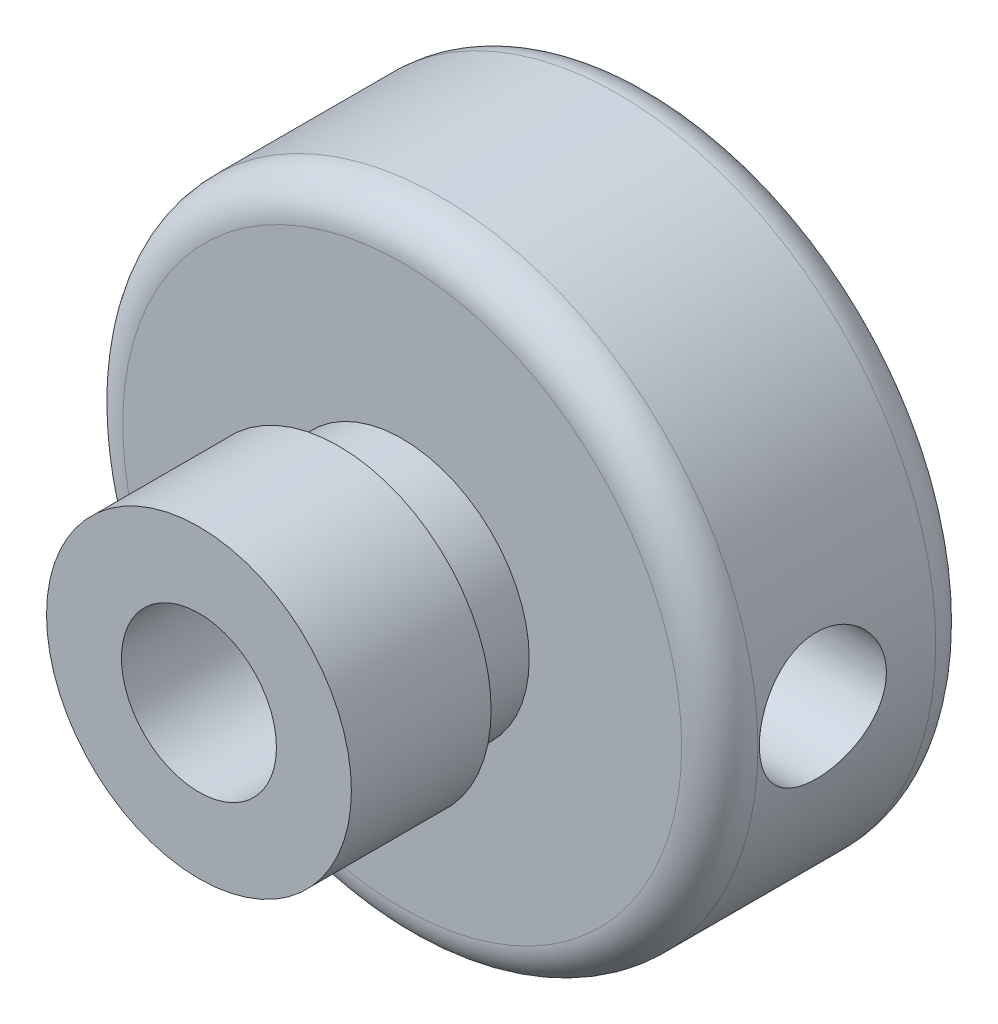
from build123d import *

# Parameters (mm, degrees)
ESQUISSE1_R             = 12.5
BASE_EXTRUSION_DEPTH    = 10
ESQUISSE2_R             = 6
BOSS_EXTRU_1_DEPTH      = 8
ESQUISSE3_R             = 3.05
ENL_V_MAT_EXTRU_1_DEPTH = 26.228951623
ESQUISSE4_R             = 5
ENL_V_MAT_EXTRU_2_DEPTH = 8
ESQUISSE5_W             = 2.5
ESQUISSE5_H             = 2
CONG_1_R                = 1.5
ESQUISSE7_R             = 2.5
ENL_V_MAT_EXTRU_4_DEPTH = 8


with BuildPart() as part:
    # Esquisse1 → Base-Extrusion (new body)
    with BuildSketch(Plane.XY):
        Circle(ESQUISSE1_R)
    extrude(amount=BASE_EXTRUSION_DEPTH)

    # Esquisse2 → Boss.-Extru.1 (add)
    with BuildSketch(Plane.XY.offset(10)):
        Circle(ESQUISSE2_R)
    extrude(amount=BOSS_EXTRU_1_DEPTH)

    # Esquisse3 → Enl_v. mat.-Extru.1 (cut, through all)
    with BuildSketch(Plane.XY.offset(18)):
        Circle(ESQUISSE3_R)
    extrude(amount=-ENL_V_MAT_EXTRU_1_DEPTH, mode=Mode.SUBTRACT)

    # Esquisse4 → Enl_v. mat.-Extru.2 (cut)
    with BuildSketch(Plane(origin=(0, 0, 0), x_dir=(-1, 0, 0), z_dir=(0, 0, -1))):
        Circle(ESQUISSE4_R)
    extrude(amount=-ENL_V_MAT_EXTRU_2_DEPTH, mode=Mode.SUBTRACT)

    # Esquisse5 → Enlever de la mati_re-R_volution1 (revolve, cut)
    with BuildSketch(Plane(origin=(0, 0, 0), x_dir=(0, 0, -1), z_dir=(1, 0, 0)), mode=Mode.PRIVATE) as enlever_de_la_mati_re_r_volution1_sk:
        with Locations((-11.25, 6)):
            Rectangle(ESQUISSE5_W, ESQUISSE5_H)
    revolve(enlever_de_la_mati_re_r_volution1_sk.sketch.rotate(Axis((0, 0, 21.399826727), (0, 0, -1)), 90), axis=Axis((0, 0, 21.399826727), (0, 0, -1)), mode=Mode.SUBTRACT)

    # Cong_1
    cong_1_edges = [part.edges().sort_by_distance(p)[0] for p in [
        (-12.5, 0, 0),
        (-12.5, 0, 10),
    ]]
    fillet(cong_1_edges, radius=CONG_1_R)

    # Esquisse7 → Enl_v. mat.-Extru.4 (cut)
    with BuildSketch(Plane(origin=(12.5, 0, 0), x_dir=(0, 0, -1), z_dir=(1, 0, 0))):
        with Locations((-5.942386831, 0)):
            Circle(ESQUISSE7_R)
    extrude(amount=-ENL_V_MAT_EXTRU_4_DEPTH, mode=Mode.SUBTRACT)


solid = part.part
